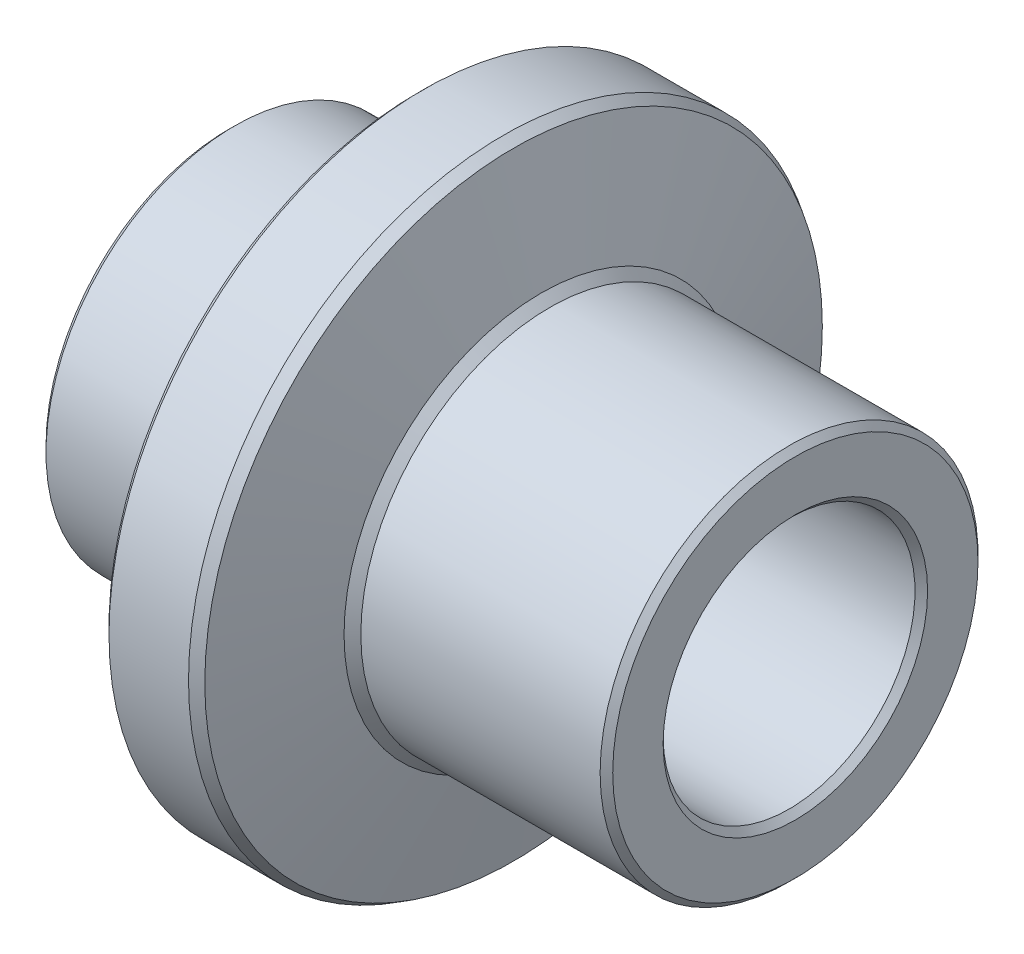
ISO-10303-21;
HEADER;
FILE_DESCRIPTION(('STEP AP214'),'2;1');
FILE_NAME('part.step','',(''),(''),'','','');
FILE_SCHEMA(('AUTOMOTIVE_DESIGN { 1 0 10303 214 1 1 1 1 }'));
ENDSEC;
DATA;
#1=APPLICATION_CONTEXT('core data for automotive mechanical design processes');
#2=APPLICATION_PROTOCOL_DEFINITION('international standard','automotive_design',2000,#1);
#3=PRODUCT_CONTEXT('',#1,'mechanical');
#4=PRODUCT('Part','Part','',(#3));
#5=PRODUCT_RELATED_PRODUCT_CATEGORY('part','',(#4));
#6=PRODUCT_DEFINITION_FORMATION('','',#4);
#7=PRODUCT_DEFINITION_CONTEXT('part definition',#1,'design');
#8=PRODUCT_DEFINITION('design','',#6,#7);
#9=PRODUCT_DEFINITION_SHAPE('','',#8);
#10=(LENGTH_UNIT() NAMED_UNIT(*) SI_UNIT(.MILLI.,.METRE.));
#11=(NAMED_UNIT(*) PLANE_ANGLE_UNIT() SI_UNIT($,.RADIAN.));
#12=(NAMED_UNIT(*) SI_UNIT($,.STERADIAN.) SOLID_ANGLE_UNIT());
#13=UNCERTAINTY_MEASURE_WITH_UNIT(LENGTH_MEASURE(1.E-05),#10,'distance_accuracy_value','');
#14=(GEOMETRIC_REPRESENTATION_CONTEXT(3) GLOBAL_UNCERTAINTY_ASSIGNED_CONTEXT((#13)) GLOBAL_UNIT_ASSIGNED_CONTEXT((#10,
#11,#12)) REPRESENTATION_CONTEXT('',''));
#15=CARTESIAN_POINT('',(0.,0.,0.));
#16=DIRECTION('',(0.,0.,1.));
#17=DIRECTION('',(1.,0.,0.));
#18=AXIS2_PLACEMENT_3D('',#15,#16,#17);
#19=CARTESIAN_POINT('',(17.9973120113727,6.,0.));
#20=DIRECTION('',(-1.,0.,0.));
#21=DIRECTION('',(0.,0.,1.));
#22=AXIS2_PLACEMENT_3D('',#19,#20,#21);
#23=PLANE('',#22);
#24=CARTESIAN_POINT('',(17.9973120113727,0.,0.));
#25=DIRECTION('',(-1.,0.,0.));
#26=DIRECTION('',(0.,0.,1.));
#27=AXIS2_PLACEMENT_3D('',#24,#25,#26);
#28=CIRCLE('',#27,5.79999999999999);
#29=CARTESIAN_POINT('',(17.9973120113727,0.,5.79999999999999));
#30=VERTEX_POINT('',#29);
#31=EDGE_CURVE('E39',#30,#30,#28,.F.);
#32=ORIENTED_EDGE('',*,*,#31,.T.);
#33=EDGE_LOOP('',(#32));
#34=FACE_BOUND('',#33,.T.);
#35=CARTESIAN_POINT('',(17.9973120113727,0.,0.));
#36=DIRECTION('',(-1.,0.,0.));
#37=DIRECTION('',(0.,0.,1.));
#38=AXIS2_PLACEMENT_3D('',#35,#36,#37);
#39=CIRCLE('',#38,4.19999999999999);
#40=CARTESIAN_POINT('',(17.9973120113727,0.,4.19999999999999));
#41=VERTEX_POINT('',#40);
#42=EDGE_CURVE('E43',#41,#41,#39,.T.);
#43=ORIENTED_EDGE('',*,*,#42,.T.);
#44=EDGE_LOOP('',(#43));
#45=FACE_BOUND('',#44,.T.);
#46=ADVANCED_FACE('F28',(#34,#45),#23,.F.);
#47=CARTESIAN_POINT('',(0.,0.,0.));
#48=DIRECTION('',(-1.,0.,0.));
#49=DIRECTION('',(0.,0.,1.));
#50=AXIS2_PLACEMENT_3D('',#47,#48,#49);
#51=CYLINDRICAL_SURFACE('',#50,3.99999999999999);
#52=CARTESIAN_POINT('',(0.200000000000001,0.,0.));
#53=DIRECTION('',(1.,0.,0.));
#54=DIRECTION('',(0.,0.,-1.));
#55=AXIS2_PLACEMENT_3D('',#52,#53,#54);
#56=CIRCLE('',#55,3.99999999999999);
#57=CARTESIAN_POINT('',(0.200000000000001,0.,-3.99999999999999));
#58=VERTEX_POINT('',#57);
#59=EDGE_CURVE('E10',#58,#58,#56,.F.);
#60=ORIENTED_EDGE('',*,*,#59,.T.);
#61=EDGE_LOOP('',(#60));
#62=FACE_BOUND('',#61,.T.);
#63=CARTESIAN_POINT('',(17.7973120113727,0.,0.));
#64=DIRECTION('',(-1.,0.,0.));
#65=DIRECTION('',(0.,0.,1.));
#66=AXIS2_PLACEMENT_3D('',#63,#64,#65);
#67=CIRCLE('',#66,3.99999999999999);
#68=CARTESIAN_POINT('',(17.7973120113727,0.,3.99999999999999));
#69=VERTEX_POINT('',#68);
#70=EDGE_CURVE('E35',#69,#69,#67,.F.);
#71=ORIENTED_EDGE('',*,*,#70,.T.);
#72=EDGE_LOOP('',(#71));
#73=FACE_BOUND('',#72,.T.);
#74=ADVANCED_FACE('F98',(#62,#73),#51,.F.);
#75=CARTESIAN_POINT('',(0.,3.99999999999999,0.));
#76=DIRECTION('',(1.,0.,0.));
#77=DIRECTION('',(0.,0.,-1.));
#78=AXIS2_PLACEMENT_3D('',#75,#76,#77);
#79=PLANE('',#78);
#80=CARTESIAN_POINT('',(0.,0.,0.));
#81=DIRECTION('',(1.,0.,0.));
#82=DIRECTION('',(0.,0.,-1.));
#83=AXIS2_PLACEMENT_3D('',#80,#81,#82);
#84=CIRCLE('',#83,5.80000000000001);
#85=CARTESIAN_POINT('',(0.,0.,-5.80000000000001));
#86=VERTEX_POINT('',#85);
#87=EDGE_CURVE('E66',#86,#86,#84,.F.);
#88=ORIENTED_EDGE('',*,*,#87,.T.);
#89=EDGE_LOOP('',(#88));
#90=FACE_BOUND('',#89,.T.);
#91=CARTESIAN_POINT('',(0.,0.,0.));
#92=DIRECTION('',(1.,0.,0.));
#93=DIRECTION('',(0.,0.,-1.));
#94=AXIS2_PLACEMENT_3D('',#91,#92,#93);
#95=CIRCLE('',#94,4.19999999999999);
#96=CARTESIAN_POINT('',(0.,0.,-4.19999999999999));
#97=VERTEX_POINT('',#96);
#98=EDGE_CURVE('E69',#97,#97,#95,.T.);
#99=ORIENTED_EDGE('',*,*,#98,.T.);
#100=EDGE_LOOP('',(#99));
#101=FACE_BOUND('',#100,.T.);
#102=ADVANCED_FACE('F95',(#90,#101),#79,.F.);
#103=CARTESIAN_POINT('',(0.,0.,0.));
#104=DIRECTION('',(-1.,0.,0.));
#105=DIRECTION('',(0.,0.,1.));
#106=AXIS2_PLACEMENT_3D('',#103,#104,#105);
#107=CYLINDRICAL_SURFACE('',#106,6.);
#108=CARTESIAN_POINT('',(5.80000000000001,0.,0.));
#109=DIRECTION('',(1.,0.,0.));
#110=DIRECTION('',(0.,0.,-1.));
#111=AXIS2_PLACEMENT_3D('',#108,#109,#110);
#112=CIRCLE('',#111,6.);
#113=CARTESIAN_POINT('',(5.80000000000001,0.,-6.));
#114=VERTEX_POINT('',#113);
#115=EDGE_CURVE('E78',#114,#114,#112,.F.);
#116=ORIENTED_EDGE('',*,*,#115,.T.);
#117=EDGE_LOOP('',(#116));
#118=FACE_BOUND('',#117,.T.);
#119=CARTESIAN_POINT('',(0.199999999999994,0.,0.));
#120=DIRECTION('',(1.,0.,0.));
#121=DIRECTION('',(0.,0.,-1.));
#122=AXIS2_PLACEMENT_3D('',#119,#120,#121);
#123=CIRCLE('',#122,6.);
#124=CARTESIAN_POINT('',(0.199999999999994,0.,-6.));
#125=VERTEX_POINT('',#124);
#126=EDGE_CURVE('E81',#125,#125,#123,.T.);
#127=ORIENTED_EDGE('',*,*,#126,.T.);
#128=EDGE_LOOP('',(#127));
#129=FACE_BOUND('',#128,.T.);
#130=ADVANCED_FACE('F85',(#118,#129),#107,.T.);
#131=CARTESIAN_POINT('',(6.,6.,0.));
#132=DIRECTION('',(1.,0.,0.));
#133=DIRECTION('',(0.,0.,-1.));
#134=AXIS2_PLACEMENT_3D('',#131,#132,#133);
#135=PLANE('',#134);
#136=CARTESIAN_POINT('',(6.,0.,0.));
#137=DIRECTION('',(1.,0.,0.));
#138=DIRECTION('',(0.,0.,-1.));
#139=AXIS2_PLACEMENT_3D('',#136,#137,#138);
#140=CIRCLE('',#139,6.19999999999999);
#141=CARTESIAN_POINT('',(6.,0.,-6.19999999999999));
#142=VERTEX_POINT('',#141);
#143=EDGE_CURVE('E72',#142,#142,#140,.T.);
#144=ORIENTED_EDGE('',*,*,#143,.T.);
#145=EDGE_LOOP('',(#144));
#146=FACE_BOUND('',#145,.T.);
#147=CARTESIAN_POINT('',(6.,0.,0.));
#148=DIRECTION('',(1.,0.,0.));
#149=DIRECTION('',(0.,0.,-1.));
#150=AXIS2_PLACEMENT_3D('',#147,#148,#149);
#151=CIRCLE('',#150,9.8);
#152=CARTESIAN_POINT('',(6.,0.,-9.8));
#153=VERTEX_POINT('',#152);
#154=EDGE_CURVE('E75',#153,#153,#151,.F.);
#155=ORIENTED_EDGE('',*,*,#154,.T.);
#156=EDGE_LOOP('',(#155));
#157=FACE_BOUND('',#156,.T.);
#158=ADVANCED_FACE('F157',(#146,#157),#135,.F.);
#159=CARTESIAN_POINT('',(0.,0.,0.));
#160=DIRECTION('',(-1.,0.,0.));
#161=DIRECTION('',(0.,0.,1.));
#162=AXIS2_PLACEMENT_3D('',#159,#160,#161);
#163=CYLINDRICAL_SURFACE('',#162,10.);
#164=CARTESIAN_POINT('',(8.72541572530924,0.,0.));
#165=DIRECTION('',(-1.,0.,0.));
#166=DIRECTION('',(0.,0.,1.));
#167=AXIS2_PLACEMENT_3D('',#164,#165,#166);
#168=CIRCLE('',#167,10.);
#169=CARTESIAN_POINT('',(8.72541572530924,0.,10.));
#170=VERTEX_POINT('',#169);
#171=EDGE_CURVE('E60',#170,#170,#168,.T.);
#172=ORIENTED_EDGE('',*,*,#171,.T.);
#173=EDGE_LOOP('',(#172));
#174=FACE_BOUND('',#173,.T.);
#175=CARTESIAN_POINT('',(6.2,0.,0.));
#176=DIRECTION('',(1.,0.,0.));
#177=DIRECTION('',(0.,0.,-1.));
#178=AXIS2_PLACEMENT_3D('',#175,#176,#177);
#179=CIRCLE('',#178,10.);
#180=CARTESIAN_POINT('',(6.2,0.,-10.));
#181=VERTEX_POINT('',#180);
#182=EDGE_CURVE('E63',#181,#181,#179,.T.);
#183=ORIENTED_EDGE('',*,*,#182,.T.);
#184=EDGE_LOOP('',(#183));
#185=FACE_BOUND('',#184,.T.);
#186=ADVANCED_FACE('F151',(#174,#185),#163,.T.);
#187=CARTESIAN_POINT('',(9.9973120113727,0.,0.));
#188=DIRECTION('',(-1.,0.,0.));
#189=DIRECTION('',(0.,0.,1.));
#190=AXIS2_PLACEMENT_3D('',#187,#188,#189);
#191=CONICAL_SURFACE('',#190,6.,1.3264502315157);
#192=CARTESIAN_POINT('',(9.04838437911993,0.,0.));
#193=DIRECTION('',(1.,0.,0.));
#194=DIRECTION('',(0.,0.,-1.));
#195=AXIS2_PLACEMENT_3D('',#192,#193,#194);
#196=CIRCLE('',#195,9.80594085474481);
#197=CARTESIAN_POINT('',(9.04838437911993,0.,-9.80594085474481));
#198=VERTEX_POINT('',#197);
#199=EDGE_CURVE('E54',#198,#198,#196,.T.);
#200=ORIENTED_EDGE('',*,*,#199,.T.);
#201=EDGE_LOOP('',(#200));
#202=FACE_BOUND('',#201,.T.);
#203=CARTESIAN_POINT('',(9.93088406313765,0.,0.));
#204=DIRECTION('',(-1.,0.,0.));
#205=DIRECTION('',(0.,0.,1.));
#206=AXIS2_PLACEMENT_3D('',#203,#204,#205);
#207=CIRCLE('',#206,6.26642794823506);
#208=CARTESIAN_POINT('',(9.93088406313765,0.,6.26642794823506));
#209=VERTEX_POINT('',#208);
#210=EDGE_CURVE('E57',#209,#209,#207,.T.);
#211=ORIENTED_EDGE('',*,*,#210,.T.);
#212=EDGE_LOOP('',(#211));
#213=FACE_BOUND('',#212,.T.);
#214=ADVANCED_FACE('F144',(#202,#213),#191,.T.);
#215=CARTESIAN_POINT('',(0.,0.,0.));
#216=DIRECTION('',(-1.,0.,0.));
#217=DIRECTION('',(0.,0.,1.));
#218=AXIS2_PLACEMENT_3D('',#215,#216,#217);
#219=CYLINDRICAL_SURFACE('',#218,6.);
#220=CARTESIAN_POINT('',(17.7973120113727,0.,0.));
#221=DIRECTION('',(-1.,0.,0.));
#222=DIRECTION('',(0.,0.,1.));
#223=AXIS2_PLACEMENT_3D('',#220,#221,#222);
#224=CIRCLE('',#223,6.);
#225=CARTESIAN_POINT('',(17.7973120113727,0.,6.));
#226=VERTEX_POINT('',#225);
#227=EDGE_CURVE('E48',#226,#226,#224,.T.);
#228=ORIENTED_EDGE('',*,*,#227,.T.);
#229=EDGE_LOOP('',(#228));
#230=FACE_BOUND('',#229,.T.);
#231=CARTESIAN_POINT('',(10.1973120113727,0.,0.));
#232=DIRECTION('',(-1.,0.,0.));
#233=DIRECTION('',(0.,0.,1.));
#234=AXIS2_PLACEMENT_3D('',#231,#232,#233);
#235=CIRCLE('',#234,6.);
#236=CARTESIAN_POINT('',(10.1973120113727,0.,6.));
#237=VERTEX_POINT('',#236);
#238=EDGE_CURVE('E51',#237,#237,#235,.F.);
#239=ORIENTED_EDGE('',*,*,#238,.T.);
#240=EDGE_LOOP('',(#239));
#241=FACE_BOUND('',#240,.T.);
#242=ADVANCED_FACE('F124',(#230,#241),#219,.T.);
#243=CARTESIAN_POINT('',(5.80000000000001,0.,0.));
#244=DIRECTION('',(1.,0.,0.));
#245=DIRECTION('',(0.,0.,-1.));
#246=AXIS2_PLACEMENT_3D('',#243,#244,#245);
#247=CONICAL_SURFACE('',#246,6.,0.785398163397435);
#248=ORIENTED_EDGE('',*,*,#143,.F.);
#249=EDGE_LOOP('',(#248));
#250=FACE_BOUND('',#249,.T.);
#251=ORIENTED_EDGE('',*,*,#115,.F.);
#252=EDGE_LOOP('',(#251));
#253=FACE_BOUND('',#252,.T.);
#254=ADVANCED_FACE('F91',(#250,#253),#247,.T.);
#255=CARTESIAN_POINT('',(0.,0.,0.));
#256=DIRECTION('',(1.,0.,0.));
#257=DIRECTION('',(0.,0.,-1.));
#258=AXIS2_PLACEMENT_3D('',#255,#256,#257);
#259=CONICAL_SURFACE('',#258,5.80000000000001,0.785398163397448);
#260=CARTESIAN_POINT('',(0.199999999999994,0.,-6.));
#261=CARTESIAN_POINT('',(0.19791666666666,0.,-5.99791666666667));
#262=CARTESIAN_POINT('',(0.195833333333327,0.,-5.99583333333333));
#263=CARTESIAN_POINT('',(0.19166666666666,0.,-5.99166666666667));
#264=CARTESIAN_POINT('',(0.189583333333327,0.,-5.98958333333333));
#265=CARTESIAN_POINT('',(0.185416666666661,0.,-5.98541666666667));
#266=CARTESIAN_POINT('',(0.183333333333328,0.,-5.98333333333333));
#267=CARTESIAN_POINT('',(0.179166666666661,0.,-5.97916666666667));
#268=CARTESIAN_POINT('',(0.177083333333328,0.,-5.97708333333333));
#269=CARTESIAN_POINT('',(0.172916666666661,0.,-5.97291666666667));
#270=CARTESIAN_POINT('',(0.170833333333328,0.,-5.97083333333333));
#271=CARTESIAN_POINT('',(0.166666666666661,0.,-5.96666666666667));
#272=CARTESIAN_POINT('',(0.164583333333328,0.,-5.96458333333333));
#273=CARTESIAN_POINT('',(0.160416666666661,0.,-5.96041666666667));
#274=CARTESIAN_POINT('',(0.158333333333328,0.,-5.95833333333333));
#275=CARTESIAN_POINT('',(0.154166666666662,0.,-5.95416666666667));
#276=CARTESIAN_POINT('',(0.152083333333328,0.,-5.95208333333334));
#277=CARTESIAN_POINT('',(0.147916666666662,0.,-5.94791666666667));
#278=CARTESIAN_POINT('',(0.145833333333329,0.,-5.94583333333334));
#279=CARTESIAN_POINT('',(0.141666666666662,0.,-5.94166666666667));
#280=CARTESIAN_POINT('',(0.139583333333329,0.,-5.93958333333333));
#281=CARTESIAN_POINT('',(0.135416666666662,0.,-5.93541666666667));
#282=CARTESIAN_POINT('',(0.133333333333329,0.,-5.93333333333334));
#283=CARTESIAN_POINT('',(0.129166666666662,0.,-5.92916666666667));
#284=CARTESIAN_POINT('',(0.127083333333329,0.,-5.92708333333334));
#285=CARTESIAN_POINT('',(0.122916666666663,0.,-5.92291666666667));
#286=CARTESIAN_POINT('',(0.120833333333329,0.,-5.92083333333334));
#287=CARTESIAN_POINT('',(0.116666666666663,0.,-5.91666666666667));
#288=CARTESIAN_POINT('',(0.11458333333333,0.,-5.91458333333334));
#289=CARTESIAN_POINT('',(0.110416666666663,0.,-5.91041666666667));
#290=CARTESIAN_POINT('',(0.10833333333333,0.,-5.90833333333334));
#291=CARTESIAN_POINT('',(0.104166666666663,0.,-5.90416666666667));
#292=CARTESIAN_POINT('',(0.10208333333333,0.,-5.90208333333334));
#293=CARTESIAN_POINT('',(0.0979166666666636,0.,-5.89791666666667));
#294=CARTESIAN_POINT('',(0.0958333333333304,0.,-5.89583333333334));
#295=CARTESIAN_POINT('',(0.0916666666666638,0.,-5.89166666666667));
#296=CARTESIAN_POINT('',(0.0895833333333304,0.,-5.88958333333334));
#297=CARTESIAN_POINT('',(0.0854166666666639,0.,-5.88541666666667));
#298=CARTESIAN_POINT('',(0.0833333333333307,0.,-5.88333333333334));
#299=CARTESIAN_POINT('',(0.0791666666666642,0.,-5.87916666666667));
#300=CARTESIAN_POINT('',(0.0770833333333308,0.,-5.87708333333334));
#301=CARTESIAN_POINT('',(0.0729166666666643,0.,-5.87291666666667));
#302=CARTESIAN_POINT('',(0.0708333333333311,0.,-5.87083333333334));
#303=CARTESIAN_POINT('',(0.0666666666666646,0.,-5.86666666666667));
#304=CARTESIAN_POINT('',(0.0645833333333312,0.,-5.86458333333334));
#305=CARTESIAN_POINT('',(0.0604166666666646,0.,-5.86041666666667));
#306=CARTESIAN_POINT('',(0.0583333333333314,0.,-5.85833333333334));
#307=CARTESIAN_POINT('',(0.054166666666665,0.,-5.85416666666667));
#308=CARTESIAN_POINT('',(0.0520833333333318,0.,-5.85208333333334));
#309=CARTESIAN_POINT('',(0.0479166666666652,0.,-5.84791666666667));
#310=CARTESIAN_POINT('',(0.0458333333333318,0.,-5.84583333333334));
#311=CARTESIAN_POINT('',(0.0416666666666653,0.,-5.84166666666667));
#312=CARTESIAN_POINT('',(0.0395833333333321,0.,-5.83958333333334));
#313=CARTESIAN_POINT('',(0.0354166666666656,0.,-5.83541666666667));
#314=CARTESIAN_POINT('',(0.0333333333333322,0.,-5.83333333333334));
#315=CARTESIAN_POINT('',(0.0291666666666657,0.,-5.82916666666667));
#316=CARTESIAN_POINT('',(0.0270833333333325,0.,-5.82708333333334));
#317=CARTESIAN_POINT('',(0.022916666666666,0.,-5.82291666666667));
#318=CARTESIAN_POINT('',(0.0208333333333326,0.,-5.82083333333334));
#319=CARTESIAN_POINT('',(0.0166666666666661,0.,-5.81666666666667));
#320=CARTESIAN_POINT('',(0.0145833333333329,0.,-5.81458333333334));
#321=CARTESIAN_POINT('',(0.0104166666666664,0.,-5.81041666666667));
#322=CARTESIAN_POINT('',(0.00833333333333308,0.,-5.80833333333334));
#323=CARTESIAN_POINT('',(0.00416666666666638,0.,-5.80416666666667));
#324=CARTESIAN_POINT('',(0.00208333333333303,0.,-5.80208333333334));
#325=CARTESIAN_POINT('',(0.,0.,-5.80000000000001));
#326=B_SPLINE_CURVE_WITH_KNOTS('',3,(#260,#261,#262,#263,#264,#265,#266,#267,#268,#269,#270,
#271,#272,#273,#274,#275,#276,#277,#278,#279,#280,#281,#282,#283,#284,#285,#286,#287,#288,#289,
#290,#291,#292,#293,#294,#295,#296,#297,#298,#299,#300,#301,#302,#303,#304,#305,#306,#307,#308,
#309,#310,#311,#312,#313,#314,#315,#316,#317,#318,#319,#320,#321,#322,#323,#324,#325),
.UNSPECIFIED.,.F.,.F.,(4,2,2,2,2,2,2,2,2,2,2,2,2,2,2,2,2,2,2,2,2,2,2,2,2,2,2,2,2,2,2,2,4),(0.,
0.00883883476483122,0.017677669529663,0.0265165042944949,0.0353553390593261,0.0441941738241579,
0.0530330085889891,0.061871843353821,0.0707106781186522,0.079549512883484,0.0883883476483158,
0.0972271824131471,0.106066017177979,0.11490485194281,0.123743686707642,0.132582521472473,
0.141421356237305,0.150260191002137,0.159099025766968,0.1679378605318,0.176776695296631,
0.185615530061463,0.194454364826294,0.203293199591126,0.212132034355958,0.220970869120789,
0.229809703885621,0.238648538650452,0.247487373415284,0.256326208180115,0.265165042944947,
0.274003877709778,0.28284271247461),.UNSPECIFIED.);
#327=EDGE_CURVE('BSEAM87',#125,#86,#326,.T.);
#328=ORIENTED_EDGE('',*,*,#126,.F.);
#329=ORIENTED_EDGE('',*,*,#87,.F.);
#330=ORIENTED_EDGE('',*,*,#327,.T.);
#331=ORIENTED_EDGE('',*,*,#327,.F.);
#332=EDGE_LOOP('',(#328,#330,#329,#331));
#333=FACE_BOUND('',#332,.T.);
#334=ADVANCED_FACE('F87',(#333),#259,.T.);
#335=CARTESIAN_POINT('',(8.72541572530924,0.,0.));
#336=DIRECTION('',(-1.,0.,0.));
#337=DIRECTION('',(0.,0.,1.));
#338=AXIS2_PLACEMENT_3D('',#335,#336,#337);
#339=CONICAL_SURFACE('',#338,10.,0.541052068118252);
#340=ORIENTED_EDGE('',*,*,#199,.F.);
#341=EDGE_LOOP('',(#340));
#342=FACE_BOUND('',#341,.T.);
#343=ORIENTED_EDGE('',*,*,#171,.F.);
#344=EDGE_LOOP('',(#343));
#345=FACE_BOUND('',#344,.T.);
#346=ADVANCED_FACE('F90',(#342,#345),#339,.T.);
#347=CARTESIAN_POINT('',(6.,0.,0.));
#348=DIRECTION('',(1.,0.,0.));
#349=DIRECTION('',(0.,0.,-1.));
#350=AXIS2_PLACEMENT_3D('',#347,#348,#349);
#351=CONICAL_SURFACE('',#350,9.8,0.785398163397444);
#352=ORIENTED_EDGE('',*,*,#182,.F.);
#353=EDGE_LOOP('',(#352));
#354=FACE_BOUND('',#353,.T.);
#355=ORIENTED_EDGE('',*,*,#154,.F.);
#356=EDGE_LOOP('',(#355));
#357=FACE_BOUND('',#356,.T.);
#358=ADVANCED_FACE('F129',(#354,#357),#351,.T.);
#359=CARTESIAN_POINT('',(17.7973120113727,0.,0.));
#360=DIRECTION('',(-1.,0.,0.));
#361=DIRECTION('',(0.,0.,1.));
#362=AXIS2_PLACEMENT_3D('',#359,#360,#361);
#363=CONICAL_SURFACE('',#362,6.,0.785398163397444);
#364=ORIENTED_EDGE('',*,*,#31,.F.);
#365=EDGE_LOOP('',(#364));
#366=FACE_BOUND('',#365,.T.);
#367=ORIENTED_EDGE('',*,*,#227,.F.);
#368=EDGE_LOOP('',(#367));
#369=FACE_BOUND('',#368,.T.);
#370=ADVANCED_FACE('F111',(#366,#369),#363,.T.);
#371=CARTESIAN_POINT('',(9.93088406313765,0.,0.));
#372=DIRECTION('',(-1.,0.,0.));
#373=DIRECTION('',(0.,0.,1.));
#374=AXIS2_PLACEMENT_3D('',#371,#372,#373);
#375=CONICAL_SURFACE('',#374,6.26642794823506,0.785398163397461);
#376=ORIENTED_EDGE('',*,*,#238,.F.);
#377=EDGE_LOOP('',(#376));
#378=FACE_BOUND('',#377,.T.);
#379=ORIENTED_EDGE('',*,*,#210,.F.);
#380=EDGE_LOOP('',(#379));
#381=FACE_BOUND('',#380,.T.);
#382=ADVANCED_FACE('F105',(#378,#381),#375,.T.);
#383=CARTESIAN_POINT('',(0.200000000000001,0.,0.));
#384=DIRECTION('',(-1.,0.,0.));
#385=DIRECTION('',(0.,0.,1.));
#386=AXIS2_PLACEMENT_3D('',#383,#384,#385);
#387=CONICAL_SURFACE('',#386,3.99999999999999,0.785398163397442);
#388=ORIENTED_EDGE('',*,*,#98,.F.);
#389=EDGE_LOOP('',(#388));
#390=FACE_BOUND('',#389,.T.);
#391=ORIENTED_EDGE('',*,*,#59,.F.);
#392=EDGE_LOOP('',(#391));
#393=FACE_BOUND('',#392,.T.);
#394=ADVANCED_FACE('F102',(#390,#393),#387,.F.);
#395=CARTESIAN_POINT('',(17.9973120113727,0.,0.));
#396=DIRECTION('',(1.,0.,0.));
#397=DIRECTION('',(0.,0.,-1.));
#398=AXIS2_PLACEMENT_3D('',#395,#396,#397);
#399=CONICAL_SURFACE('',#398,4.19999999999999,0.785398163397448);
#400=ORIENTED_EDGE('',*,*,#70,.F.);
#401=EDGE_LOOP('',(#400));
#402=FACE_BOUND('',#401,.T.);
#403=ORIENTED_EDGE('',*,*,#42,.F.);
#404=EDGE_LOOP('',(#403));
#405=FACE_BOUND('',#404,.T.);
#406=ADVANCED_FACE('F30',(#402,#405),#399,.F.);
#407=CLOSED_SHELL('',(#46,#74,#102,#130,#158,#186,#214,#242,#254,#334,#346,#358,#370,#382,#394,#406));
#408=MANIFOLD_SOLID_BREP('B2',#407);
#409=ADVANCED_BREP_SHAPE_REPRESENTATION('',(#18,#408),#14);
#410=SHAPE_DEFINITION_REPRESENTATION(#9,#409);
ENDSEC;
END-ISO-10303-21;
